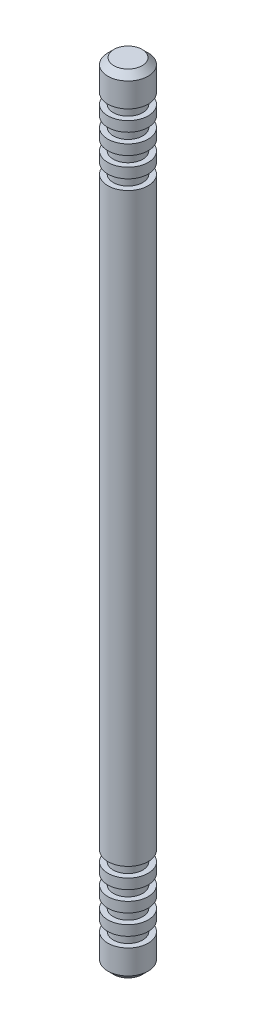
ISO-10303-21;
HEADER;
FILE_DESCRIPTION(('STEP AP214'),'2;1');
FILE_NAME('part.step','',(''),(''),'','','');
FILE_SCHEMA(('AUTOMOTIVE_DESIGN { 1 0 10303 214 1 1 1 1 }'));
ENDSEC;
DATA;
#1=APPLICATION_CONTEXT('core data for automotive mechanical design processes');
#2=APPLICATION_PROTOCOL_DEFINITION('international standard','automotive_design',2000,#1);
#3=PRODUCT_CONTEXT('',#1,'mechanical');
#4=PRODUCT('Part','Part','',(#3));
#5=PRODUCT_RELATED_PRODUCT_CATEGORY('part','',(#4));
#6=PRODUCT_DEFINITION_FORMATION('','',#4);
#7=PRODUCT_DEFINITION_CONTEXT('part definition',#1,'design');
#8=PRODUCT_DEFINITION('design','',#6,#7);
#9=PRODUCT_DEFINITION_SHAPE('','',#8);
#10=(LENGTH_UNIT() NAMED_UNIT(*) SI_UNIT(.MILLI.,.METRE.));
#11=(NAMED_UNIT(*) PLANE_ANGLE_UNIT() SI_UNIT($,.RADIAN.));
#12=(NAMED_UNIT(*) SI_UNIT($,.STERADIAN.) SOLID_ANGLE_UNIT());
#13=UNCERTAINTY_MEASURE_WITH_UNIT(LENGTH_MEASURE(1.E-05),#10,'distance_accuracy_value','');
#14=(GEOMETRIC_REPRESENTATION_CONTEXT(3) GLOBAL_UNCERTAINTY_ASSIGNED_CONTEXT((#13)) GLOBAL_UNIT_ASSIGNED_CONTEXT((#10,
#11,#12)) REPRESENTATION_CONTEXT('',''));
#15=CARTESIAN_POINT('',(0.,0.,0.));
#16=DIRECTION('',(0.,0.,1.));
#17=DIRECTION('',(1.,0.,0.));
#18=AXIS2_PLACEMENT_3D('',#15,#16,#17);
#19=CARTESIAN_POINT('',(-25.0925604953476,-54.7900027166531,0.));
#20=DIRECTION('',(0.,-1.,0.));
#21=DIRECTION('',(1.,0.,0.));
#22=AXIS2_PLACEMENT_3D('',#19,#20,#21);
#23=PLANE('',#22);
#24=CARTESIAN_POINT('',(-25.0925604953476,-54.7900027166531,0.));
#25=DIRECTION('',(0.,-1.,0.));
#26=DIRECTION('',(1.,0.,0.));
#27=AXIS2_PLACEMENT_3D('',#24,#25,#26);
#28=CIRCLE('',#27,0.700000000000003);
#29=CARTESIAN_POINT('',(-24.3925604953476,-54.7900027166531,0.));
#30=VERTEX_POINT('',#29);
#31=EDGE_CURVE('E10',#30,#30,#28,.F.);
#32=ORIENTED_EDGE('',*,*,#31,.T.);
#33=EDGE_LOOP('',(#32));
#34=FACE_BOUND('',#33,.T.);
#35=ADVANCED_FACE('F32',(#34),#23,.F.);
#36=CARTESIAN_POINT('',(-25.0925604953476,-54.7900027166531,0.));
#37=DIRECTION('',(0.,-1.,0.));
#38=DIRECTION('',(1.,0.,0.));
#39=AXIS2_PLACEMENT_3D('',#36,#37,#38);
#40=CYLINDRICAL_SURFACE('',#39,0.999999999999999);
#41=CARTESIAN_POINT('',(-25.0925604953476,-55.0900027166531,0.));
#42=DIRECTION('',(0.,-1.,0.));
#43=DIRECTION('',(0.,0.,-1.));
#44=AXIS2_PLACEMENT_3D('',#41,#42,#43);
#45=CIRCLE('',#44,0.999999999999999);
#46=CARTESIAN_POINT('',(-25.0925604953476,-55.0900027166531,-0.999999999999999));
#47=VERTEX_POINT('',#46);
#48=EDGE_CURVE('E38',#47,#47,#45,.T.);
#49=ORIENTED_EDGE('',*,*,#48,.T.);
#50=EDGE_LOOP('',(#49));
#51=FACE_BOUND('',#50,.T.);
#52=CARTESIAN_POINT('',(-25.0925604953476,-56.2900027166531,0.));
#53=DIRECTION('',(0.,-1.,0.));
#54=DIRECTION('',(1.,0.,0.));
#55=AXIS2_PLACEMENT_3D('',#52,#53,#54);
#56=CIRCLE('',#55,0.999999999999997);
#57=CARTESIAN_POINT('',(-24.0925604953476,-56.2900027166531,0.));
#58=VERTEX_POINT('',#57);
#59=EDGE_CURVE('E51',#58,#58,#56,.T.);
#60=ORIENTED_EDGE('',*,*,#59,.F.);
#61=EDGE_LOOP('',(#60));
#62=FACE_BOUND('',#61,.T.);
#63=ADVANCED_FACE('F333',(#51,#62),#40,.T.);
#64=CARTESIAN_POINT('',(-26.0925604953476,-56.2900027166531,0.));
#65=DIRECTION('',(0.,1.,0.));
#66=DIRECTION('',(-1.,0.,0.));
#67=AXIS2_PLACEMENT_3D('',#64,#65,#66);
#68=PLANE('',#67);
#69=CARTESIAN_POINT('',(-25.0925604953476,-56.2900027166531,0.));
#70=DIRECTION('',(0.,-1.,0.));
#71=DIRECTION('',(1.,0.,0.));
#72=AXIS2_PLACEMENT_3D('',#69,#70,#71);
#73=CIRCLE('',#72,0.730000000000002);
#74=CARTESIAN_POINT('',(-24.3625604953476,-56.2900027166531,0.));
#75=VERTEX_POINT('',#74);
#76=EDGE_CURVE('E54',#75,#75,#73,.T.);
#77=ORIENTED_EDGE('',*,*,#76,.F.);
#78=EDGE_LOOP('',(#77));
#79=FACE_BOUND('',#78,.T.);
#80=ORIENTED_EDGE('',*,*,#59,.T.);
#81=EDGE_LOOP('',(#80));
#82=FACE_BOUND('',#81,.T.);
#83=ADVANCED_FACE('F327',(#79,#82),#68,.F.);
#84=CARTESIAN_POINT('',(-25.0925604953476,-54.7900027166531,0.));
#85=DIRECTION('',(0.,-1.,0.));
#86=DIRECTION('',(1.,0.,0.));
#87=AXIS2_PLACEMENT_3D('',#84,#85,#86);
#88=CYLINDRICAL_SURFACE('',#87,0.730000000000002);
#89=CARTESIAN_POINT('',(-25.0925604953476,-56.7900027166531,0.));
#90=DIRECTION('',(0.,-1.,0.));
#91=DIRECTION('',(1.,0.,0.));
#92=AXIS2_PLACEMENT_3D('',#89,#90,#91);
#93=CIRCLE('',#92,0.730000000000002);
#94=CARTESIAN_POINT('',(-24.3625604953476,-56.7900027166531,0.));
#95=VERTEX_POINT('',#94);
#96=EDGE_CURVE('E57',#95,#95,#93,.T.);
#97=ORIENTED_EDGE('',*,*,#96,.F.);
#98=EDGE_LOOP('',(#97));
#99=FACE_BOUND('',#98,.T.);
#100=ORIENTED_EDGE('',*,*,#76,.T.);
#101=EDGE_LOOP('',(#100));
#102=FACE_BOUND('',#101,.T.);
#103=ADVANCED_FACE('F321',(#99,#102),#88,.T.);
#104=CARTESIAN_POINT('',(-25.8225604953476,-56.7900027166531,0.));
#105=DIRECTION('',(0.,-1.,0.));
#106=DIRECTION('',(1.,0.,0.));
#107=AXIS2_PLACEMENT_3D('',#104,#105,#106);
#108=PLANE('',#107);
#109=CARTESIAN_POINT('',(-25.0925604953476,-56.7900027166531,0.));
#110=DIRECTION('',(0.,-1.,0.));
#111=DIRECTION('',(1.,0.,0.));
#112=AXIS2_PLACEMENT_3D('',#109,#110,#111);
#113=CIRCLE('',#112,1.);
#114=CARTESIAN_POINT('',(-24.0925604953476,-56.7900027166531,0.));
#115=VERTEX_POINT('',#114);
#116=EDGE_CURVE('E60',#115,#115,#113,.T.);
#117=ORIENTED_EDGE('',*,*,#116,.F.);
#118=EDGE_LOOP('',(#117));
#119=FACE_BOUND('',#118,.T.);
#120=ORIENTED_EDGE('',*,*,#96,.T.);
#121=EDGE_LOOP('',(#120));
#122=FACE_BOUND('',#121,.T.);
#123=ADVANCED_FACE('F315',(#119,#122),#108,.F.);
#124=CARTESIAN_POINT('',(-25.0925604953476,-54.7900027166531,0.));
#125=DIRECTION('',(0.,-1.,0.));
#126=DIRECTION('',(1.,0.,0.));
#127=AXIS2_PLACEMENT_3D('',#124,#125,#126);
#128=CYLINDRICAL_SURFACE('',#127,0.999999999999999);
#129=CARTESIAN_POINT('',(-25.0925604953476,-57.2900027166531,0.));
#130=DIRECTION('',(0.,-1.,0.));
#131=DIRECTION('',(1.,0.,0.));
#132=AXIS2_PLACEMENT_3D('',#129,#130,#131);
#133=CIRCLE('',#132,0.999999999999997);
#134=CARTESIAN_POINT('',(-24.0925604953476,-57.2900027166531,0.));
#135=VERTEX_POINT('',#134);
#136=EDGE_CURVE('E63',#135,#135,#133,.T.);
#137=ORIENTED_EDGE('',*,*,#136,.F.);
#138=EDGE_LOOP('',(#137));
#139=FACE_BOUND('',#138,.T.);
#140=ORIENTED_EDGE('',*,*,#116,.T.);
#141=EDGE_LOOP('',(#140));
#142=FACE_BOUND('',#141,.T.);
#143=ADVANCED_FACE('F309',(#139,#142),#128,.T.);
#144=CARTESIAN_POINT('',(-26.0925604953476,-57.2900027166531,0.));
#145=DIRECTION('',(0.,1.,0.));
#146=DIRECTION('',(-1.,0.,0.));
#147=AXIS2_PLACEMENT_3D('',#144,#145,#146);
#148=PLANE('',#147);
#149=CARTESIAN_POINT('',(-25.0925604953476,-57.2900027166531,0.));
#150=DIRECTION('',(0.,-1.,0.));
#151=DIRECTION('',(1.,0.,0.));
#152=AXIS2_PLACEMENT_3D('',#149,#150,#151);
#153=CIRCLE('',#152,0.730000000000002);
#154=CARTESIAN_POINT('',(-24.3625604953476,-57.2900027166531,0.));
#155=VERTEX_POINT('',#154);
#156=EDGE_CURVE('E66',#155,#155,#153,.T.);
#157=ORIENTED_EDGE('',*,*,#156,.F.);
#158=EDGE_LOOP('',(#157));
#159=FACE_BOUND('',#158,.T.);
#160=ORIENTED_EDGE('',*,*,#136,.T.);
#161=EDGE_LOOP('',(#160));
#162=FACE_BOUND('',#161,.T.);
#163=ADVANCED_FACE('F303',(#159,#162),#148,.F.);
#164=CARTESIAN_POINT('',(-25.0925604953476,-54.7900027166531,0.));
#165=DIRECTION('',(0.,-1.,0.));
#166=DIRECTION('',(1.,0.,0.));
#167=AXIS2_PLACEMENT_3D('',#164,#165,#166);
#168=CYLINDRICAL_SURFACE('',#167,0.73);
#169=CARTESIAN_POINT('',(-25.0925604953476,-57.7900027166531,0.));
#170=DIRECTION('',(0.,-1.,0.));
#171=DIRECTION('',(1.,0.,0.));
#172=AXIS2_PLACEMENT_3D('',#169,#170,#171);
#173=CIRCLE('',#172,0.729999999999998);
#174=CARTESIAN_POINT('',(-24.3625604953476,-57.7900027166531,0.));
#175=VERTEX_POINT('',#174);
#176=EDGE_CURVE('E69',#175,#175,#173,.T.);
#177=ORIENTED_EDGE('',*,*,#176,.F.);
#178=EDGE_LOOP('',(#177));
#179=FACE_BOUND('',#178,.T.);
#180=ORIENTED_EDGE('',*,*,#156,.T.);
#181=EDGE_LOOP('',(#180));
#182=FACE_BOUND('',#181,.T.);
#183=ADVANCED_FACE('F297',(#179,#182),#168,.T.);
#184=CARTESIAN_POINT('',(-25.8225604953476,-57.7900027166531,0.));
#185=DIRECTION('',(0.,-1.,0.));
#186=DIRECTION('',(1.,0.,0.));
#187=AXIS2_PLACEMENT_3D('',#184,#185,#186);
#188=PLANE('',#187);
#189=CARTESIAN_POINT('',(-25.0925604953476,-57.7900027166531,0.));
#190=DIRECTION('',(0.,-1.,0.));
#191=DIRECTION('',(1.,0.,0.));
#192=AXIS2_PLACEMENT_3D('',#189,#190,#191);
#193=CIRCLE('',#192,1.);
#194=CARTESIAN_POINT('',(-24.0925604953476,-57.7900027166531,0.));
#195=VERTEX_POINT('',#194);
#196=EDGE_CURVE('E72',#195,#195,#193,.T.);
#197=ORIENTED_EDGE('',*,*,#196,.F.);
#198=EDGE_LOOP('',(#197));
#199=FACE_BOUND('',#198,.T.);
#200=ORIENTED_EDGE('',*,*,#176,.T.);
#201=EDGE_LOOP('',(#200));
#202=FACE_BOUND('',#201,.T.);
#203=ADVANCED_FACE('F291',(#199,#202),#188,.F.);
#204=CARTESIAN_POINT('',(-25.0925604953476,-54.7900027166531,0.));
#205=DIRECTION('',(0.,-1.,0.));
#206=DIRECTION('',(1.,0.,0.));
#207=AXIS2_PLACEMENT_3D('',#204,#205,#206);
#208=CYLINDRICAL_SURFACE('',#207,1.);
#209=CARTESIAN_POINT('',(-25.0925604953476,-58.2900027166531,0.));
#210=DIRECTION('',(0.,-1.,0.));
#211=DIRECTION('',(1.,0.,0.));
#212=AXIS2_PLACEMENT_3D('',#209,#210,#211);
#213=CIRCLE('',#212,1.);
#214=CARTESIAN_POINT('',(-24.0925604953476,-58.2900027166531,0.));
#215=VERTEX_POINT('',#214);
#216=EDGE_CURVE('E75',#215,#215,#213,.T.);
#217=ORIENTED_EDGE('',*,*,#216,.F.);
#218=EDGE_LOOP('',(#217));
#219=FACE_BOUND('',#218,.T.);
#220=ORIENTED_EDGE('',*,*,#196,.T.);
#221=EDGE_LOOP('',(#220));
#222=FACE_BOUND('',#221,.T.);
#223=ADVANCED_FACE('F285',(#219,#222),#208,.T.);
#224=CARTESIAN_POINT('',(-26.0925604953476,-58.2900027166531,0.));
#225=DIRECTION('',(0.,1.,0.));
#226=DIRECTION('',(-1.,0.,0.));
#227=AXIS2_PLACEMENT_3D('',#224,#225,#226);
#228=PLANE('',#227);
#229=CARTESIAN_POINT('',(-25.0925604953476,-58.2900027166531,0.));
#230=DIRECTION('',(0.,-1.,0.));
#231=DIRECTION('',(1.,0.,0.));
#232=AXIS2_PLACEMENT_3D('',#229,#230,#231);
#233=CIRCLE('',#232,0.730000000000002);
#234=CARTESIAN_POINT('',(-24.3625604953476,-58.2900027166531,0.));
#235=VERTEX_POINT('',#234);
#236=EDGE_CURVE('E78',#235,#235,#233,.T.);
#237=ORIENTED_EDGE('',*,*,#236,.F.);
#238=EDGE_LOOP('',(#237));
#239=FACE_BOUND('',#238,.T.);
#240=ORIENTED_EDGE('',*,*,#216,.T.);
#241=EDGE_LOOP('',(#240));
#242=FACE_BOUND('',#241,.T.);
#243=ADVANCED_FACE('F279',(#239,#242),#228,.F.);
#244=CARTESIAN_POINT('',(-25.0925604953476,-54.7900027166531,0.));
#245=DIRECTION('',(0.,-1.,0.));
#246=DIRECTION('',(1.,0.,0.));
#247=AXIS2_PLACEMENT_3D('',#244,#245,#246);
#248=CYLINDRICAL_SURFACE('',#247,0.73);
#249=CARTESIAN_POINT('',(-25.0925604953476,-58.7900027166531,0.));
#250=DIRECTION('',(0.,-1.,0.));
#251=DIRECTION('',(1.,0.,0.));
#252=AXIS2_PLACEMENT_3D('',#249,#250,#251);
#253=CIRCLE('',#252,0.729999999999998);
#254=CARTESIAN_POINT('',(-24.3625604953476,-58.7900027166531,0.));
#255=VERTEX_POINT('',#254);
#256=EDGE_CURVE('E81',#255,#255,#253,.T.);
#257=ORIENTED_EDGE('',*,*,#256,.F.);
#258=EDGE_LOOP('',(#257));
#259=FACE_BOUND('',#258,.T.);
#260=ORIENTED_EDGE('',*,*,#236,.T.);
#261=EDGE_LOOP('',(#260));
#262=FACE_BOUND('',#261,.T.);
#263=ADVANCED_FACE('F273',(#259,#262),#248,.T.);
#264=CARTESIAN_POINT('',(-25.8225604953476,-58.7900027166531,0.));
#265=DIRECTION('',(0.,-1.,0.));
#266=DIRECTION('',(1.,0.,0.));
#267=AXIS2_PLACEMENT_3D('',#264,#265,#266);
#268=PLANE('',#267);
#269=CARTESIAN_POINT('',(-25.0925604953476,-58.7900027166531,0.));
#270=DIRECTION('',(0.,-1.,0.));
#271=DIRECTION('',(1.,0.,0.));
#272=AXIS2_PLACEMENT_3D('',#269,#270,#271);
#273=CIRCLE('',#272,1.);
#274=CARTESIAN_POINT('',(-24.0925604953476,-58.7900027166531,0.));
#275=VERTEX_POINT('',#274);
#276=EDGE_CURVE('E84',#275,#275,#273,.T.);
#277=ORIENTED_EDGE('',*,*,#276,.F.);
#278=EDGE_LOOP('',(#277));
#279=FACE_BOUND('',#278,.T.);
#280=ORIENTED_EDGE('',*,*,#256,.T.);
#281=EDGE_LOOP('',(#280));
#282=FACE_BOUND('',#281,.T.);
#283=ADVANCED_FACE('F267',(#279,#282),#268,.F.);
#284=CARTESIAN_POINT('',(-25.0925604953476,-54.7900027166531,0.));
#285=DIRECTION('',(0.,-1.,0.));
#286=DIRECTION('',(1.,0.,0.));
#287=AXIS2_PLACEMENT_3D('',#284,#285,#286);
#288=CYLINDRICAL_SURFACE('',#287,1.);
#289=CARTESIAN_POINT('',(-25.0925604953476,-59.2900027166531,0.));
#290=DIRECTION('',(0.,-1.,0.));
#291=DIRECTION('',(1.,0.,0.));
#292=AXIS2_PLACEMENT_3D('',#289,#290,#291);
#293=CIRCLE('',#292,1.);
#294=CARTESIAN_POINT('',(-24.0925604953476,-59.2900027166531,0.));
#295=VERTEX_POINT('',#294);
#296=EDGE_CURVE('E87',#295,#295,#293,.T.);
#297=ORIENTED_EDGE('',*,*,#296,.F.);
#298=EDGE_LOOP('',(#297));
#299=FACE_BOUND('',#298,.T.);
#300=ORIENTED_EDGE('',*,*,#276,.T.);
#301=EDGE_LOOP('',(#300));
#302=FACE_BOUND('',#301,.T.);
#303=ADVANCED_FACE('F261',(#299,#302),#288,.T.);
#304=CARTESIAN_POINT('',(-26.0925604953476,-59.2900027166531,0.));
#305=DIRECTION('',(0.,1.,0.));
#306=DIRECTION('',(-1.,0.,0.));
#307=AXIS2_PLACEMENT_3D('',#304,#305,#306);
#308=PLANE('',#307);
#309=CARTESIAN_POINT('',(-25.0925604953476,-59.2900027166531,0.));
#310=DIRECTION('',(0.,-1.,0.));
#311=DIRECTION('',(1.,0.,0.));
#312=AXIS2_PLACEMENT_3D('',#309,#310,#311);
#313=CIRCLE('',#312,0.730000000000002);
#314=CARTESIAN_POINT('',(-24.3625604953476,-59.2900027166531,0.));
#315=VERTEX_POINT('',#314);
#316=EDGE_CURVE('E90',#315,#315,#313,.T.);
#317=ORIENTED_EDGE('',*,*,#316,.F.);
#318=EDGE_LOOP('',(#317));
#319=FACE_BOUND('',#318,.T.);
#320=ORIENTED_EDGE('',*,*,#296,.T.);
#321=EDGE_LOOP('',(#320));
#322=FACE_BOUND('',#321,.T.);
#323=ADVANCED_FACE('F255',(#319,#322),#308,.F.);
#324=CARTESIAN_POINT('',(-25.0925604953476,-54.7900027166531,0.));
#325=DIRECTION('',(0.,-1.,0.));
#326=DIRECTION('',(1.,0.,0.));
#327=AXIS2_PLACEMENT_3D('',#324,#325,#326);
#328=CYLINDRICAL_SURFACE('',#327,0.73);
#329=CARTESIAN_POINT('',(-25.0925604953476,-59.7900027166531,0.));
#330=DIRECTION('',(0.,-1.,0.));
#331=DIRECTION('',(1.,0.,0.));
#332=AXIS2_PLACEMENT_3D('',#329,#330,#331);
#333=CIRCLE('',#332,0.729999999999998);
#334=CARTESIAN_POINT('',(-24.3625604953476,-59.7900027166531,0.));
#335=VERTEX_POINT('',#334);
#336=EDGE_CURVE('E93',#335,#335,#333,.T.);
#337=ORIENTED_EDGE('',*,*,#336,.F.);
#338=EDGE_LOOP('',(#337));
#339=FACE_BOUND('',#338,.T.);
#340=ORIENTED_EDGE('',*,*,#316,.T.);
#341=EDGE_LOOP('',(#340));
#342=FACE_BOUND('',#341,.T.);
#343=ADVANCED_FACE('F249',(#339,#342),#328,.T.);
#344=CARTESIAN_POINT('',(-25.8225604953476,-59.7900027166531,0.));
#345=DIRECTION('',(0.,-1.,0.));
#346=DIRECTION('',(1.,0.,0.));
#347=AXIS2_PLACEMENT_3D('',#344,#345,#346);
#348=PLANE('',#347);
#349=CARTESIAN_POINT('',(-25.0925604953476,-59.7900027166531,0.));
#350=DIRECTION('',(0.,-1.,0.));
#351=DIRECTION('',(1.,0.,0.));
#352=AXIS2_PLACEMENT_3D('',#349,#350,#351);
#353=CIRCLE('',#352,1.);
#354=CARTESIAN_POINT('',(-24.0925604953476,-59.7900027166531,0.));
#355=VERTEX_POINT('',#354);
#356=EDGE_CURVE('E96',#355,#355,#353,.T.);
#357=ORIENTED_EDGE('',*,*,#356,.F.);
#358=EDGE_LOOP('',(#357));
#359=FACE_BOUND('',#358,.T.);
#360=ORIENTED_EDGE('',*,*,#336,.T.);
#361=EDGE_LOOP('',(#360));
#362=FACE_BOUND('',#361,.T.);
#363=ADVANCED_FACE('F243',(#359,#362),#348,.F.);
#364=CARTESIAN_POINT('',(-25.0925604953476,-54.7900027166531,0.));
#365=DIRECTION('',(0.,-1.,0.));
#366=DIRECTION('',(1.,0.,0.));
#367=AXIS2_PLACEMENT_3D('',#364,#365,#366);
#368=CYLINDRICAL_SURFACE('',#367,0.999999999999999);
#369=CARTESIAN_POINT('',(-25.0925604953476,-88.7900027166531,0.));
#370=DIRECTION('',(0.,-1.,0.));
#371=DIRECTION('',(1.,0.,0.));
#372=AXIS2_PLACEMENT_3D('',#369,#370,#371);
#373=CIRCLE('',#372,0.999999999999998);
#374=CARTESIAN_POINT('',(-24.0925604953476,-88.7900027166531,0.));
#375=VERTEX_POINT('',#374);
#376=EDGE_CURVE('E99',#375,#375,#373,.T.);
#377=ORIENTED_EDGE('',*,*,#376,.F.);
#378=EDGE_LOOP('',(#377));
#379=FACE_BOUND('',#378,.T.);
#380=ORIENTED_EDGE('',*,*,#356,.T.);
#381=EDGE_LOOP('',(#380));
#382=FACE_BOUND('',#381,.T.);
#383=ADVANCED_FACE('F237',(#379,#382),#368,.T.);
#384=CARTESIAN_POINT('',(-26.0925604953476,-88.7900027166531,0.));
#385=DIRECTION('',(0.,1.,0.));
#386=DIRECTION('',(-1.,0.,0.));
#387=AXIS2_PLACEMENT_3D('',#384,#385,#386);
#388=PLANE('',#387);
#389=CARTESIAN_POINT('',(-25.0925604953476,-88.7900027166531,0.));
#390=DIRECTION('',(0.,-1.,0.));
#391=DIRECTION('',(1.,0.,0.));
#392=AXIS2_PLACEMENT_3D('',#389,#390,#391);
#393=CIRCLE('',#392,0.729999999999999);
#394=CARTESIAN_POINT('',(-24.3625604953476,-88.7900027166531,0.));
#395=VERTEX_POINT('',#394);
#396=EDGE_CURVE('E102',#395,#395,#393,.T.);
#397=ORIENTED_EDGE('',*,*,#396,.F.);
#398=EDGE_LOOP('',(#397));
#399=FACE_BOUND('',#398,.T.);
#400=ORIENTED_EDGE('',*,*,#376,.T.);
#401=EDGE_LOOP('',(#400));
#402=FACE_BOUND('',#401,.T.);
#403=ADVANCED_FACE('F231',(#399,#402),#388,.F.);
#404=CARTESIAN_POINT('',(-25.0925604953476,-54.7900027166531,0.));
#405=DIRECTION('',(0.,-1.,0.));
#406=DIRECTION('',(1.,0.,0.));
#407=AXIS2_PLACEMENT_3D('',#404,#405,#406);
#408=CYLINDRICAL_SURFACE('',#407,0.729999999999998);
#409=CARTESIAN_POINT('',(-25.0925604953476,-89.2900027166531,0.));
#410=DIRECTION('',(0.,-1.,0.));
#411=DIRECTION('',(1.,0.,0.));
#412=AXIS2_PLACEMENT_3D('',#409,#410,#411);
#413=CIRCLE('',#412,0.729999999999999);
#414=CARTESIAN_POINT('',(-24.3625604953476,-89.2900027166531,0.));
#415=VERTEX_POINT('',#414);
#416=EDGE_CURVE('E105',#415,#415,#413,.T.);
#417=ORIENTED_EDGE('',*,*,#416,.F.);
#418=EDGE_LOOP('',(#417));
#419=FACE_BOUND('',#418,.T.);
#420=ORIENTED_EDGE('',*,*,#396,.T.);
#421=EDGE_LOOP('',(#420));
#422=FACE_BOUND('',#421,.T.);
#423=ADVANCED_FACE('F225',(#419,#422),#408,.T.);
#424=CARTESIAN_POINT('',(-25.8225604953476,-89.2900027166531,0.));
#425=DIRECTION('',(0.,-1.,0.));
#426=DIRECTION('',(1.,0.,0.));
#427=AXIS2_PLACEMENT_3D('',#424,#425,#426);
#428=PLANE('',#427);
#429=CARTESIAN_POINT('',(-25.0925604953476,-89.2900027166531,0.));
#430=DIRECTION('',(0.,-1.,0.));
#431=DIRECTION('',(1.,0.,0.));
#432=AXIS2_PLACEMENT_3D('',#429,#430,#431);
#433=CIRCLE('',#432,0.999999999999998);
#434=CARTESIAN_POINT('',(-24.0925604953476,-89.2900027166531,0.));
#435=VERTEX_POINT('',#434);
#436=EDGE_CURVE('E108',#435,#435,#433,.T.);
#437=ORIENTED_EDGE('',*,*,#436,.F.);
#438=EDGE_LOOP('',(#437));
#439=FACE_BOUND('',#438,.T.);
#440=ORIENTED_EDGE('',*,*,#416,.T.);
#441=EDGE_LOOP('',(#440));
#442=FACE_BOUND('',#441,.T.);
#443=ADVANCED_FACE('F219',(#439,#442),#428,.F.);
#444=CARTESIAN_POINT('',(-25.0925604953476,-54.7900027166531,0.));
#445=DIRECTION('',(0.,-1.,0.));
#446=DIRECTION('',(1.,0.,0.));
#447=AXIS2_PLACEMENT_3D('',#444,#445,#446);
#448=CYLINDRICAL_SURFACE('',#447,0.999999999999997);
#449=CARTESIAN_POINT('',(-25.0925604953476,-89.7900027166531,0.));
#450=DIRECTION('',(0.,-1.,0.));
#451=DIRECTION('',(1.,0.,0.));
#452=AXIS2_PLACEMENT_3D('',#449,#450,#451);
#453=CIRCLE('',#452,0.999999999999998);
#454=CARTESIAN_POINT('',(-24.0925604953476,-89.7900027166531,0.));
#455=VERTEX_POINT('',#454);
#456=EDGE_CURVE('E111',#455,#455,#453,.T.);
#457=ORIENTED_EDGE('',*,*,#456,.F.);
#458=EDGE_LOOP('',(#457));
#459=FACE_BOUND('',#458,.T.);
#460=ORIENTED_EDGE('',*,*,#436,.T.);
#461=EDGE_LOOP('',(#460));
#462=FACE_BOUND('',#461,.T.);
#463=ADVANCED_FACE('F213',(#459,#462),#448,.T.);
#464=CARTESIAN_POINT('',(-26.0925604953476,-89.7900027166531,0.));
#465=DIRECTION('',(0.,1.,0.));
#466=DIRECTION('',(-1.,0.,0.));
#467=AXIS2_PLACEMENT_3D('',#464,#465,#466);
#468=PLANE('',#467);
#469=CARTESIAN_POINT('',(-25.0925604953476,-89.7900027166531,0.));
#470=DIRECTION('',(0.,-1.,0.));
#471=DIRECTION('',(1.,0.,0.));
#472=AXIS2_PLACEMENT_3D('',#469,#470,#471);
#473=CIRCLE('',#472,0.729999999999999);
#474=CARTESIAN_POINT('',(-24.3625604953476,-89.7900027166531,0.));
#475=VERTEX_POINT('',#474);
#476=EDGE_CURVE('E114',#475,#475,#473,.T.);
#477=ORIENTED_EDGE('',*,*,#476,.F.);
#478=EDGE_LOOP('',(#477));
#479=FACE_BOUND('',#478,.T.);
#480=ORIENTED_EDGE('',*,*,#456,.T.);
#481=EDGE_LOOP('',(#480));
#482=FACE_BOUND('',#481,.T.);
#483=ADVANCED_FACE('F207',(#479,#482),#468,.F.);
#484=CARTESIAN_POINT('',(-25.0925604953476,-54.7900027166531,0.));
#485=DIRECTION('',(0.,-1.,0.));
#486=DIRECTION('',(1.,0.,0.));
#487=AXIS2_PLACEMENT_3D('',#484,#485,#486);
#488=CYLINDRICAL_SURFACE('',#487,0.729999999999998);
#489=CARTESIAN_POINT('',(-25.0925604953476,-90.2900027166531,0.));
#490=DIRECTION('',(0.,-1.,0.));
#491=DIRECTION('',(1.,0.,0.));
#492=AXIS2_PLACEMENT_3D('',#489,#490,#491);
#493=CIRCLE('',#492,0.729999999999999);
#494=CARTESIAN_POINT('',(-24.3625604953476,-90.2900027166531,0.));
#495=VERTEX_POINT('',#494);
#496=EDGE_CURVE('E117',#495,#495,#493,.T.);
#497=ORIENTED_EDGE('',*,*,#496,.F.);
#498=EDGE_LOOP('',(#497));
#499=FACE_BOUND('',#498,.T.);
#500=ORIENTED_EDGE('',*,*,#476,.T.);
#501=EDGE_LOOP('',(#500));
#502=FACE_BOUND('',#501,.T.);
#503=ADVANCED_FACE('F201',(#499,#502),#488,.T.);
#504=CARTESIAN_POINT('',(-25.8225604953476,-90.2900027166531,0.));
#505=DIRECTION('',(0.,-1.,0.));
#506=DIRECTION('',(1.,0.,0.));
#507=AXIS2_PLACEMENT_3D('',#504,#505,#506);
#508=PLANE('',#507);
#509=CARTESIAN_POINT('',(-25.0925604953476,-90.2900027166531,0.));
#510=DIRECTION('',(0.,-1.,0.));
#511=DIRECTION('',(1.,0.,0.));
#512=AXIS2_PLACEMENT_3D('',#509,#510,#511);
#513=CIRCLE('',#512,0.999999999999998);
#514=CARTESIAN_POINT('',(-24.0925604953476,-90.2900027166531,0.));
#515=VERTEX_POINT('',#514);
#516=EDGE_CURVE('E120',#515,#515,#513,.T.);
#517=ORIENTED_EDGE('',*,*,#516,.F.);
#518=EDGE_LOOP('',(#517));
#519=FACE_BOUND('',#518,.T.);
#520=ORIENTED_EDGE('',*,*,#496,.T.);
#521=EDGE_LOOP('',(#520));
#522=FACE_BOUND('',#521,.T.);
#523=ADVANCED_FACE('F195',(#519,#522),#508,.F.);
#524=CARTESIAN_POINT('',(-25.0925604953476,-54.7900027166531,0.));
#525=DIRECTION('',(0.,-1.,0.));
#526=DIRECTION('',(1.,0.,0.));
#527=AXIS2_PLACEMENT_3D('',#524,#525,#526);
#528=CYLINDRICAL_SURFACE('',#527,0.999999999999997);
#529=CARTESIAN_POINT('',(-25.0925604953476,-90.7900027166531,0.));
#530=DIRECTION('',(0.,-1.,0.));
#531=DIRECTION('',(1.,0.,0.));
#532=AXIS2_PLACEMENT_3D('',#529,#530,#531);
#533=CIRCLE('',#532,0.999999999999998);
#534=CARTESIAN_POINT('',(-24.0925604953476,-90.7900027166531,0.));
#535=VERTEX_POINT('',#534);
#536=EDGE_CURVE('E123',#535,#535,#533,.T.);
#537=ORIENTED_EDGE('',*,*,#536,.F.);
#538=EDGE_LOOP('',(#537));
#539=FACE_BOUND('',#538,.T.);
#540=ORIENTED_EDGE('',*,*,#516,.T.);
#541=EDGE_LOOP('',(#540));
#542=FACE_BOUND('',#541,.T.);
#543=ADVANCED_FACE('F189',(#539,#542),#528,.T.);
#544=CARTESIAN_POINT('',(-26.0925604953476,-90.7900027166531,0.));
#545=DIRECTION('',(0.,1.,0.));
#546=DIRECTION('',(-1.,0.,0.));
#547=AXIS2_PLACEMENT_3D('',#544,#545,#546);
#548=PLANE('',#547);
#549=CARTESIAN_POINT('',(-25.0925604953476,-90.7900027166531,0.));
#550=DIRECTION('',(0.,-1.,0.));
#551=DIRECTION('',(1.,0.,0.));
#552=AXIS2_PLACEMENT_3D('',#549,#550,#551);
#553=CIRCLE('',#552,0.729999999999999);
#554=CARTESIAN_POINT('',(-24.3625604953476,-90.7900027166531,0.));
#555=VERTEX_POINT('',#554);
#556=EDGE_CURVE('E126',#555,#555,#553,.T.);
#557=ORIENTED_EDGE('',*,*,#556,.F.);
#558=EDGE_LOOP('',(#557));
#559=FACE_BOUND('',#558,.T.);
#560=ORIENTED_EDGE('',*,*,#536,.T.);
#561=EDGE_LOOP('',(#560));
#562=FACE_BOUND('',#561,.T.);
#563=ADVANCED_FACE('F183',(#559,#562),#548,.F.);
#564=CARTESIAN_POINT('',(-25.0925604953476,-54.7900027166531,0.));
#565=DIRECTION('',(0.,-1.,0.));
#566=DIRECTION('',(1.,0.,0.));
#567=AXIS2_PLACEMENT_3D('',#564,#565,#566);
#568=CYLINDRICAL_SURFACE('',#567,0.729999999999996);
#569=CARTESIAN_POINT('',(-25.0925604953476,-91.2900027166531,0.));
#570=DIRECTION('',(0.,-1.,0.));
#571=DIRECTION('',(1.,0.,0.));
#572=AXIS2_PLACEMENT_3D('',#569,#570,#571);
#573=CIRCLE('',#572,0.729999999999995);
#574=CARTESIAN_POINT('',(-24.3625604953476,-91.2900027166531,0.));
#575=VERTEX_POINT('',#574);
#576=EDGE_CURVE('E129',#575,#575,#573,.T.);
#577=ORIENTED_EDGE('',*,*,#576,.F.);
#578=EDGE_LOOP('',(#577));
#579=FACE_BOUND('',#578,.T.);
#580=ORIENTED_EDGE('',*,*,#556,.T.);
#581=EDGE_LOOP('',(#580));
#582=FACE_BOUND('',#581,.T.);
#583=ADVANCED_FACE('F177',(#579,#582),#568,.T.);
#584=CARTESIAN_POINT('',(-25.8225604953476,-91.2900027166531,0.));
#585=DIRECTION('',(0.,-1.,0.));
#586=DIRECTION('',(1.,0.,0.));
#587=AXIS2_PLACEMENT_3D('',#584,#585,#586);
#588=PLANE('',#587);
#589=CARTESIAN_POINT('',(-25.0925604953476,-91.2900027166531,0.));
#590=DIRECTION('',(0.,-1.,0.));
#591=DIRECTION('',(1.,0.,0.));
#592=AXIS2_PLACEMENT_3D('',#589,#590,#591);
#593=CIRCLE('',#592,0.999999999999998);
#594=CARTESIAN_POINT('',(-24.0925604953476,-91.2900027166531,0.));
#595=VERTEX_POINT('',#594);
#596=EDGE_CURVE('E132',#595,#595,#593,.T.);
#597=ORIENTED_EDGE('',*,*,#596,.F.);
#598=EDGE_LOOP('',(#597));
#599=FACE_BOUND('',#598,.T.);
#600=ORIENTED_EDGE('',*,*,#576,.T.);
#601=EDGE_LOOP('',(#600));
#602=FACE_BOUND('',#601,.T.);
#603=ADVANCED_FACE('F171',(#599,#602),#588,.F.);
#604=CARTESIAN_POINT('',(-25.0925604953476,-54.7900027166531,0.));
#605=DIRECTION('',(0.,-1.,0.));
#606=DIRECTION('',(1.,0.,0.));
#607=AXIS2_PLACEMENT_3D('',#604,#605,#606);
#608=CYLINDRICAL_SURFACE('',#607,0.999999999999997);
#609=CARTESIAN_POINT('',(-25.0925604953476,-91.7900027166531,0.));
#610=DIRECTION('',(0.,-1.,0.));
#611=DIRECTION('',(1.,0.,0.));
#612=AXIS2_PLACEMENT_3D('',#609,#610,#611);
#613=CIRCLE('',#612,0.999999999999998);
#614=CARTESIAN_POINT('',(-24.0925604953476,-91.7900027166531,0.));
#615=VERTEX_POINT('',#614);
#616=EDGE_CURVE('E135',#615,#615,#613,.T.);
#617=ORIENTED_EDGE('',*,*,#616,.F.);
#618=EDGE_LOOP('',(#617));
#619=FACE_BOUND('',#618,.T.);
#620=ORIENTED_EDGE('',*,*,#596,.T.);
#621=EDGE_LOOP('',(#620));
#622=FACE_BOUND('',#621,.T.);
#623=ADVANCED_FACE('F165',(#619,#622),#608,.T.);
#624=CARTESIAN_POINT('',(-25.8225604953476,-91.7900027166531,0.));
#625=DIRECTION('',(0.,1.,0.));
#626=DIRECTION('',(-1.,0.,0.));
#627=AXIS2_PLACEMENT_3D('',#624,#625,#626);
#628=PLANE('',#627);
#629=CARTESIAN_POINT('',(-25.0925604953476,-91.7900027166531,0.));
#630=DIRECTION('',(0.,-1.,0.));
#631=DIRECTION('',(1.,0.,0.));
#632=AXIS2_PLACEMENT_3D('',#629,#630,#631);
#633=CIRCLE('',#632,0.729999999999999);
#634=CARTESIAN_POINT('',(-24.3625604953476,-91.7900027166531,0.));
#635=VERTEX_POINT('',#634);
#636=EDGE_CURVE('E138',#635,#635,#633,.T.);
#637=ORIENTED_EDGE('',*,*,#636,.F.);
#638=EDGE_LOOP('',(#637));
#639=FACE_BOUND('',#638,.T.);
#640=ORIENTED_EDGE('',*,*,#616,.T.);
#641=EDGE_LOOP('',(#640));
#642=FACE_BOUND('',#641,.T.);
#643=ADVANCED_FACE('F159',(#639,#642),#628,.F.);
#644=CARTESIAN_POINT('',(-25.0925604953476,-54.7900027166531,0.));
#645=DIRECTION('',(0.,-1.,0.));
#646=DIRECTION('',(1.,0.,0.));
#647=AXIS2_PLACEMENT_3D('',#644,#645,#646);
#648=CYLINDRICAL_SURFACE('',#647,0.73);
#649=CARTESIAN_POINT('',(-25.0925604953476,-92.2900027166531,0.));
#650=DIRECTION('',(0.,-1.,0.));
#651=DIRECTION('',(1.,0.,0.));
#652=AXIS2_PLACEMENT_3D('',#649,#650,#651);
#653=CIRCLE('',#652,0.730000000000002);
#654=CARTESIAN_POINT('',(-24.3625604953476,-92.2900027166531,0.));
#655=VERTEX_POINT('',#654);
#656=EDGE_CURVE('E141',#655,#655,#653,.T.);
#657=ORIENTED_EDGE('',*,*,#656,.F.);
#658=EDGE_LOOP('',(#657));
#659=FACE_BOUND('',#658,.T.);
#660=ORIENTED_EDGE('',*,*,#636,.T.);
#661=EDGE_LOOP('',(#660));
#662=FACE_BOUND('',#661,.T.);
#663=ADVANCED_FACE('F153',(#659,#662),#648,.T.);
#664=CARTESIAN_POINT('',(-25.8225604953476,-92.2900027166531,0.));
#665=DIRECTION('',(0.,-1.,0.));
#666=DIRECTION('',(1.,0.,0.));
#667=AXIS2_PLACEMENT_3D('',#664,#665,#666);
#668=PLANE('',#667);
#669=CARTESIAN_POINT('',(-25.0925604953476,-92.2900027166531,0.));
#670=DIRECTION('',(0.,-1.,0.));
#671=DIRECTION('',(1.,0.,0.));
#672=AXIS2_PLACEMENT_3D('',#669,#670,#671);
#673=CIRCLE('',#672,0.999999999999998);
#674=CARTESIAN_POINT('',(-24.0925604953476,-92.2900027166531,0.));
#675=VERTEX_POINT('',#674);
#676=EDGE_CURVE('E144',#675,#675,#673,.T.);
#677=ORIENTED_EDGE('',*,*,#676,.F.);
#678=EDGE_LOOP('',(#677));
#679=FACE_BOUND('',#678,.T.);
#680=ORIENTED_EDGE('',*,*,#656,.T.);
#681=EDGE_LOOP('',(#680));
#682=FACE_BOUND('',#681,.T.);
#683=ADVANCED_FACE('F150',(#679,#682),#668,.F.);
#684=CARTESIAN_POINT('',(-25.0925604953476,-54.7900027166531,0.));
#685=DIRECTION('',(0.,-1.,0.));
#686=DIRECTION('',(1.,0.,0.));
#687=AXIS2_PLACEMENT_3D('',#684,#685,#686);
#688=CYLINDRICAL_SURFACE('',#687,0.999999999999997);
#689=CARTESIAN_POINT('',(-25.0925604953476,-93.4900027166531,0.));
#690=DIRECTION('',(0.,1.,0.));
#691=DIRECTION('',(0.,0.,1.));
#692=AXIS2_PLACEMENT_3D('',#689,#690,#691);
#693=CIRCLE('',#692,0.999999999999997);
#694=CARTESIAN_POINT('',(-25.0925604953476,-93.4900027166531,0.999999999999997));
#695=VERTEX_POINT('',#694);
#696=EDGE_CURVE('E42',#695,#695,#693,.T.);
#697=ORIENTED_EDGE('',*,*,#696,.T.);
#698=EDGE_LOOP('',(#697));
#699=FACE_BOUND('',#698,.T.);
#700=ORIENTED_EDGE('',*,*,#676,.T.);
#701=EDGE_LOOP('',(#700));
#702=FACE_BOUND('',#701,.T.);
#703=ADVANCED_FACE('F148',(#699,#702),#688,.T.);
#704=CARTESIAN_POINT('',(-26.0925604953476,-93.7900027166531,0.));
#705=DIRECTION('',(0.,1.,0.));
#706=DIRECTION('',(-1.,0.,0.));
#707=AXIS2_PLACEMENT_3D('',#704,#705,#706);
#708=PLANE('',#707);
#709=CARTESIAN_POINT('',(-25.0925604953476,-93.7900027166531,0.));
#710=DIRECTION('',(0.,1.,0.));
#711=DIRECTION('',(-1.,0.,0.));
#712=AXIS2_PLACEMENT_3D('',#709,#710,#711);
#713=CIRCLE('',#712,0.700000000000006);
#714=CARTESIAN_POINT('',(-25.7925604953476,-93.7900027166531,0.));
#715=VERTEX_POINT('',#714);
#716=EDGE_CURVE('E46',#715,#715,#713,.F.);
#717=ORIENTED_EDGE('',*,*,#716,.T.);
#718=EDGE_LOOP('',(#717));
#719=FACE_BOUND('',#718,.T.);
#720=ADVANCED_FACE('F344',(#719),#708,.F.);
#721=CARTESIAN_POINT('',(-25.0925604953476,-93.7900027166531,0.));
#722=DIRECTION('',(0.,1.,0.));
#723=DIRECTION('',(0.,0.,1.));
#724=AXIS2_PLACEMENT_3D('',#721,#722,#723);
#725=CONICAL_SURFACE('',#724,0.700000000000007,0.785398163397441);
#726=ORIENTED_EDGE('',*,*,#696,.F.);
#727=EDGE_LOOP('',(#726));
#728=FACE_BOUND('',#727,.T.);
#729=ORIENTED_EDGE('',*,*,#716,.F.);
#730=EDGE_LOOP('',(#729));
#731=FACE_BOUND('',#730,.T.);
#732=ADVANCED_FACE('F348',(#728,#731),#725,.T.);
#733=CARTESIAN_POINT('',(-25.0925604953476,-55.0900027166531,0.));
#734=DIRECTION('',(0.,-1.,0.));
#735=DIRECTION('',(0.,0.,-1.));
#736=AXIS2_PLACEMENT_3D('',#733,#734,#735);
#737=CONICAL_SURFACE('',#736,0.999999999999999,0.78539816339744);
#738=ORIENTED_EDGE('',*,*,#31,.F.);
#739=EDGE_LOOP('',(#738));
#740=FACE_BOUND('',#739,.T.);
#741=ORIENTED_EDGE('',*,*,#48,.F.);
#742=EDGE_LOOP('',(#741));
#743=FACE_BOUND('',#742,.T.);
#744=ADVANCED_FACE('F352',(#740,#743),#737,.T.);
#745=CLOSED_SHELL('',(#35,#63,#83,#103,#123,#143,#163,#183,#203,#223,#243,#263,#283,#303,#323,
#343,#363,#383,#403,#423,#443,#463,#483,#503,#523,#543,#563,#583,#603,#623,#643,#663,#683,#703,
#720,#732,#744));
#746=MANIFOLD_SOLID_BREP('B2',#745);
#747=ADVANCED_BREP_SHAPE_REPRESENTATION('',(#18,#746),#14);
#748=SHAPE_DEFINITION_REPRESENTATION(#9,#747);
ENDSEC;
END-ISO-10303-21;
